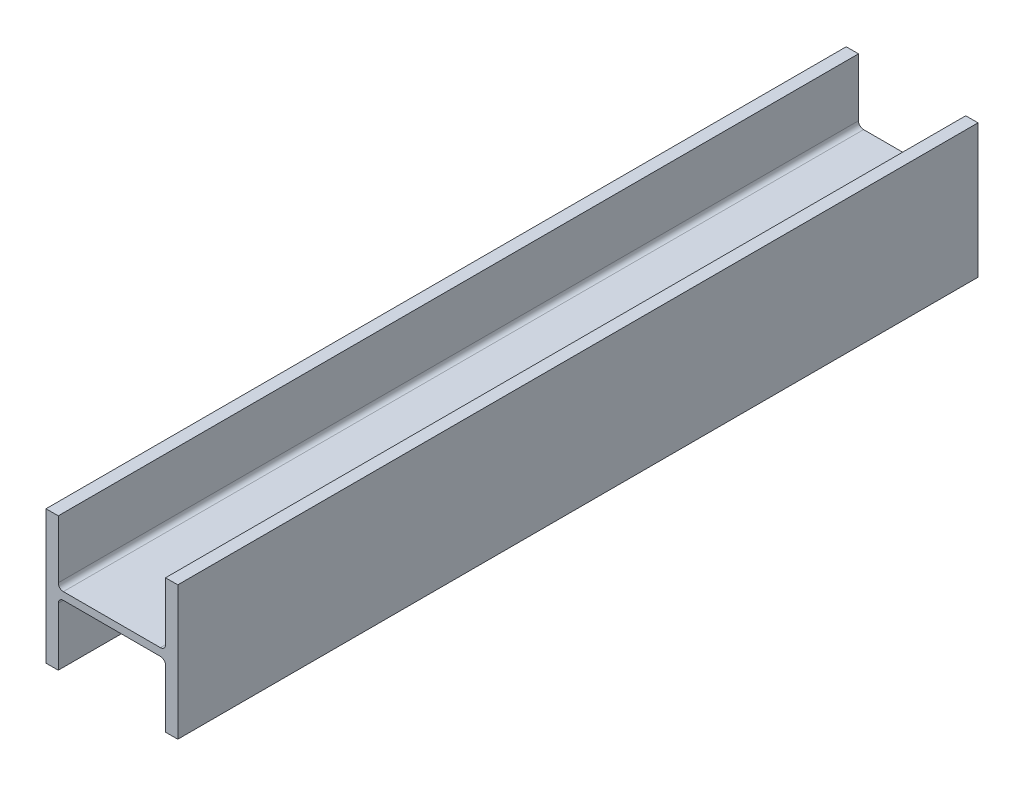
ISO-10303-21;
HEADER;
FILE_DESCRIPTION(('STEP AP214'),'2;1');
FILE_NAME('part.step','',(''),(''),'','','');
FILE_SCHEMA(('AUTOMOTIVE_DESIGN { 1 0 10303 214 1 1 1 1 }'));
ENDSEC;
DATA;
#1=APPLICATION_CONTEXT('core data for automotive mechanical design processes');
#2=APPLICATION_PROTOCOL_DEFINITION('international standard','automotive_design',2000,#1);
#3=PRODUCT_CONTEXT('',#1,'mechanical');
#4=PRODUCT('Part','Part','',(#3));
#5=PRODUCT_RELATED_PRODUCT_CATEGORY('part','',(#4));
#6=PRODUCT_DEFINITION_FORMATION('','',#4);
#7=PRODUCT_DEFINITION_CONTEXT('part definition',#1,'design');
#8=PRODUCT_DEFINITION('design','',#6,#7);
#9=PRODUCT_DEFINITION_SHAPE('','',#8);
#10=(LENGTH_UNIT() NAMED_UNIT(*) SI_UNIT(.MILLI.,.METRE.));
#11=(NAMED_UNIT(*) PLANE_ANGLE_UNIT() SI_UNIT($,.RADIAN.));
#12=(NAMED_UNIT(*) SI_UNIT($,.STERADIAN.) SOLID_ANGLE_UNIT());
#13=UNCERTAINTY_MEASURE_WITH_UNIT(LENGTH_MEASURE(1.E-05),#10,'distance_accuracy_value','');
#14=(GEOMETRIC_REPRESENTATION_CONTEXT(3) GLOBAL_UNCERTAINTY_ASSIGNED_CONTEXT((#13)) GLOBAL_UNIT_ASSIGNED_CONTEXT((#10,
#11,#12)) REPRESENTATION_CONTEXT('',''));
#15=CARTESIAN_POINT('',(0.,0.,0.));
#16=DIRECTION('',(0.,0.,1.));
#17=DIRECTION('',(1.,0.,0.));
#18=AXIS2_PLACEMENT_3D('',#15,#16,#17);
#19=CARTESIAN_POINT('',(196.596,199.517,1193.8));
#20=DIRECTION('',(-1.,0.,0.));
#21=DIRECTION('',(0.,0.,1.));
#22=AXIS2_PLACEMENT_3D('',#19,#20,#21);
#23=PLANE('',#22);
#24=DIRECTION('',(0.,1.,0.));
#25=VECTOR('',#24,1.);
#26=CARTESIAN_POINT('',(196.596,199.517,-1193.8));
#27=LINE('',#26,#25);
#28=CARTESIAN_POINT('',(196.596,-199.517,-1193.8));
#29=VERTEX_POINT('',#28);
#30=CARTESIAN_POINT('',(196.596,199.517,-1193.8));
#31=VERTEX_POINT('',#30);
#32=EDGE_CURVE('E195',#29,#31,#27,.T.);
#33=ORIENTED_EDGE('',*,*,#32,.T.);
#34=DIRECTION('',(0.,0.,-1.));
#35=VECTOR('',#34,1.);
#36=CARTESIAN_POINT('',(196.596,199.517,1193.8));
#37=LINE('',#36,#35);
#38=CARTESIAN_POINT('',(196.596,199.517,1193.8));
#39=VERTEX_POINT('',#38);
#40=EDGE_CURVE('E11',#39,#31,#37,.T.);
#41=ORIENTED_EDGE('',*,*,#40,.F.);
#42=DIRECTION('',(0.,1.,0.));
#43=VECTOR('',#42,1.);
#44=CARTESIAN_POINT('',(196.596,199.517,1193.8));
#45=LINE('',#44,#43);
#46=CARTESIAN_POINT('',(196.596,-199.517,1193.8));
#47=VERTEX_POINT('',#46);
#48=EDGE_CURVE('E238',#47,#39,#45,.T.);
#49=ORIENTED_EDGE('',*,*,#48,.F.);
#50=DIRECTION('',(0.,0.,-1.));
#51=VECTOR('',#50,1.);
#52=CARTESIAN_POINT('',(196.596,-199.517,1193.8));
#53=LINE('',#52,#51);
#54=EDGE_CURVE('E188',#47,#29,#53,.T.);
#55=ORIENTED_EDGE('',*,*,#54,.T.);
#56=EDGE_LOOP('',(#33,#41,#49,#55));
#57=FACE_BOUND('',#56,.T.);
#58=ADVANCED_FACE('F44',(#57),#23,.F.);
#59=CARTESIAN_POINT('',(160.02,199.517,1193.8));
#60=DIRECTION('',(0.,-1.,0.));
#61=DIRECTION('',(0.,0.,-1.));
#62=AXIS2_PLACEMENT_3D('',#59,#60,#61);
#63=PLANE('',#62);
#64=DIRECTION('',(-1.,0.,0.));
#65=VECTOR('',#64,1.);
#66=CARTESIAN_POINT('',(160.02,199.517,-1193.8));
#67=LINE('',#66,#65);
#68=CARTESIAN_POINT('',(160.02,199.517,-1193.8));
#69=VERTEX_POINT('',#68);
#70=EDGE_CURVE('E196',#31,#69,#67,.T.);
#71=ORIENTED_EDGE('',*,*,#70,.T.);
#72=DIRECTION('',(0.,0.,-1.));
#73=VECTOR('',#72,1.);
#74=CARTESIAN_POINT('',(160.02,199.517,1193.8));
#75=LINE('',#74,#73);
#76=CARTESIAN_POINT('',(160.02,199.517,1193.8));
#77=VERTEX_POINT('',#76);
#78=EDGE_CURVE('E53',#77,#69,#75,.T.);
#79=ORIENTED_EDGE('',*,*,#78,.F.);
#80=DIRECTION('',(-1.,0.,0.));
#81=VECTOR('',#80,1.);
#82=CARTESIAN_POINT('',(160.02,199.517,1193.8));
#83=LINE('',#82,#81);
#84=EDGE_CURVE('E129',#39,#77,#83,.T.);
#85=ORIENTED_EDGE('',*,*,#84,.F.);
#86=ORIENTED_EDGE('',*,*,#40,.T.);
#87=EDGE_LOOP('',(#71,#79,#85,#86));
#88=FACE_BOUND('',#87,.T.);
#89=ADVANCED_FACE('F362',(#88),#63,.F.);
#90=CARTESIAN_POINT('',(160.02,26.5430000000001,1193.8));
#91=DIRECTION('',(1.,0.,0.));
#92=DIRECTION('',(0.,0.,-1.));
#93=AXIS2_PLACEMENT_3D('',#90,#91,#92);
#94=PLANE('',#93);
#95=DIRECTION('',(0.,-1.,0.));
#96=VECTOR('',#95,1.);
#97=CARTESIAN_POINT('',(160.02,26.5430000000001,-1193.8));
#98=LINE('',#97,#96);
#99=CARTESIAN_POINT('',(160.02,26.5430000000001,-1193.8));
#100=VERTEX_POINT('',#99);
#101=EDGE_CURVE('E203',#69,#100,#98,.T.);
#102=ORIENTED_EDGE('',*,*,#101,.T.);
#103=DIRECTION('',(0.,0.,-1.));
#104=VECTOR('',#103,1.);
#105=CARTESIAN_POINT('',(160.02,26.5430000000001,1193.8));
#106=LINE('',#105,#104);
#107=CARTESIAN_POINT('',(160.02,26.5430000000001,1193.8));
#108=VERTEX_POINT('',#107);
#109=EDGE_CURVE('E285',#108,#100,#106,.T.);
#110=ORIENTED_EDGE('',*,*,#109,.F.);
#111=DIRECTION('',(0.,-1.,0.));
#112=VECTOR('',#111,1.);
#113=CARTESIAN_POINT('',(160.02,26.5430000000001,1193.8));
#114=LINE('',#113,#112);
#115=EDGE_CURVE('E291',#77,#108,#114,.T.);
#116=ORIENTED_EDGE('',*,*,#115,.F.);
#117=ORIENTED_EDGE('',*,*,#78,.T.);
#118=EDGE_LOOP('',(#102,#110,#116,#117));
#119=FACE_BOUND('',#118,.T.);
#120=ADVANCED_FACE('F292',(#119),#94,.F.);
#121=CARTESIAN_POINT('',(144.78,26.5430000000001,1193.8));
#122=DIRECTION('',(0.,0.,-1.));
#123=DIRECTION('',(-1.,0.,0.));
#124=AXIS2_PLACEMENT_3D('',#121,#122,#123);
#125=CYLINDRICAL_SURFACE('',#124,15.24);
#126=CARTESIAN_POINT('',(144.78,26.5430000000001,-1193.8));
#127=DIRECTION('',(0.,0.,-1.));
#128=DIRECTION('',(1.,0.,0.));
#129=AXIS2_PLACEMENT_3D('',#126,#127,#128);
#130=CIRCLE('',#129,15.24);
#131=CARTESIAN_POINT('',(144.78,11.3030000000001,-1193.8));
#132=VERTEX_POINT('',#131);
#133=EDGE_CURVE('E204',#100,#132,#130,.T.);
#134=ORIENTED_EDGE('',*,*,#133,.T.);
#135=DIRECTION('',(0.,0.,-1.));
#136=VECTOR('',#135,1.);
#137=CARTESIAN_POINT('',(144.78,11.3030000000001,1193.8));
#138=LINE('',#137,#136);
#139=CARTESIAN_POINT('',(144.78,11.3030000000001,1193.8));
#140=VERTEX_POINT('',#139);
#141=EDGE_CURVE('E276',#140,#132,#138,.T.);
#142=ORIENTED_EDGE('',*,*,#141,.F.);
#143=CARTESIAN_POINT('',(144.78,26.5430000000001,1193.8));
#144=DIRECTION('',(0.,0.,-1.));
#145=DIRECTION('',(1.,0.,0.));
#146=AXIS2_PLACEMENT_3D('',#143,#144,#145);
#147=CIRCLE('',#146,15.24);
#148=EDGE_CURVE('E315',#108,#140,#147,.T.);
#149=ORIENTED_EDGE('',*,*,#148,.F.);
#150=ORIENTED_EDGE('',*,*,#109,.T.);
#151=EDGE_LOOP('',(#134,#142,#149,#150));
#152=FACE_BOUND('',#151,.T.);
#153=ADVANCED_FACE('F304',(#152),#125,.F.);
#154=CARTESIAN_POINT('',(-144.78,11.3030000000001,1193.8));
#155=DIRECTION('',(0.,-1.,0.));
#156=DIRECTION('',(1.,0.,0.));
#157=AXIS2_PLACEMENT_3D('',#154,#155,#156);
#158=PLANE('',#157);
#159=DIRECTION('',(-1.,0.,0.));
#160=VECTOR('',#159,1.);
#161=CARTESIAN_POINT('',(-144.78,11.3030000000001,-1193.8));
#162=LINE('',#161,#160);
#163=CARTESIAN_POINT('',(-144.78,11.3030000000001,-1193.8));
#164=VERTEX_POINT('',#163);
#165=EDGE_CURVE('E210',#132,#164,#162,.T.);
#166=ORIENTED_EDGE('',*,*,#165,.T.);
#167=DIRECTION('',(0.,0.,-1.));
#168=VECTOR('',#167,1.);
#169=CARTESIAN_POINT('',(-144.78,11.3030000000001,1193.8));
#170=LINE('',#169,#168);
#171=CARTESIAN_POINT('',(-144.78,11.3030000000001,1193.8));
#172=VERTEX_POINT('',#171);
#173=EDGE_CURVE('E274',#172,#164,#170,.T.);
#174=ORIENTED_EDGE('',*,*,#173,.F.);
#175=DIRECTION('',(-1.,0.,0.));
#176=VECTOR('',#175,1.);
#177=CARTESIAN_POINT('',(-144.78,11.3030000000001,1193.8));
#178=LINE('',#177,#176);
#179=EDGE_CURVE('E306',#140,#172,#178,.T.);
#180=ORIENTED_EDGE('',*,*,#179,.F.);
#181=ORIENTED_EDGE('',*,*,#141,.T.);
#182=EDGE_LOOP('',(#166,#174,#180,#181));
#183=FACE_BOUND('',#182,.T.);
#184=ADVANCED_FACE('F308',(#183),#158,.F.);
#185=CARTESIAN_POINT('',(-144.78,26.5430000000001,1193.8));
#186=DIRECTION('',(0.,0.,-1.));
#187=DIRECTION('',(-1.,0.,0.));
#188=AXIS2_PLACEMENT_3D('',#185,#186,#187);
#189=CYLINDRICAL_SURFACE('',#188,15.24);
#190=CARTESIAN_POINT('',(-144.78,26.5430000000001,-1193.8));
#191=DIRECTION('',(0.,0.,-1.));
#192=DIRECTION('',(1.,0.,0.));
#193=AXIS2_PLACEMENT_3D('',#190,#191,#192);
#194=CIRCLE('',#193,15.24);
#195=CARTESIAN_POINT('',(-160.02,26.5430000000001,-1193.8));
#196=VERTEX_POINT('',#195);
#197=EDGE_CURVE('E209',#164,#196,#194,.T.);
#198=ORIENTED_EDGE('',*,*,#197,.T.);
#199=DIRECTION('',(0.,0.,-1.));
#200=VECTOR('',#199,1.);
#201=CARTESIAN_POINT('',(-160.02,26.5430000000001,1193.8));
#202=LINE('',#201,#200);
#203=CARTESIAN_POINT('',(-160.02,26.5430000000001,1193.8));
#204=VERTEX_POINT('',#203);
#205=EDGE_CURVE('E271',#204,#196,#202,.T.);
#206=ORIENTED_EDGE('',*,*,#205,.F.);
#207=CARTESIAN_POINT('',(-144.78,26.5430000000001,1193.8));
#208=DIRECTION('',(0.,0.,-1.));
#209=DIRECTION('',(1.,0.,0.));
#210=AXIS2_PLACEMENT_3D('',#207,#208,#209);
#211=CIRCLE('',#210,15.24);
#212=EDGE_CURVE('E313',#172,#204,#211,.T.);
#213=ORIENTED_EDGE('',*,*,#212,.F.);
#214=ORIENTED_EDGE('',*,*,#173,.T.);
#215=EDGE_LOOP('',(#198,#206,#213,#214));
#216=FACE_BOUND('',#215,.T.);
#217=ADVANCED_FACE('F374',(#216),#189,.F.);
#218=CARTESIAN_POINT('',(-160.02,199.517,1193.8));
#219=DIRECTION('',(-1.,0.,0.));
#220=DIRECTION('',(0.,0.,1.));
#221=AXIS2_PLACEMENT_3D('',#218,#219,#220);
#222=PLANE('',#221);
#223=DIRECTION('',(0.,1.,0.));
#224=VECTOR('',#223,1.);
#225=CARTESIAN_POINT('',(-160.02,199.517,-1193.8));
#226=LINE('',#225,#224);
#227=CARTESIAN_POINT('',(-160.02,199.517,-1193.8));
#228=VERTEX_POINT('',#227);
#229=EDGE_CURVE('E213',#196,#228,#226,.T.);
#230=ORIENTED_EDGE('',*,*,#229,.T.);
#231=DIRECTION('',(0.,0.,-1.));
#232=VECTOR('',#231,1.);
#233=CARTESIAN_POINT('',(-160.02,199.517,1193.8));
#234=LINE('',#233,#232);
#235=CARTESIAN_POINT('',(-160.02,199.517,1193.8));
#236=VERTEX_POINT('',#235);
#237=EDGE_CURVE('E270',#236,#228,#234,.T.);
#238=ORIENTED_EDGE('',*,*,#237,.F.);
#239=DIRECTION('',(0.,1.,0.));
#240=VECTOR('',#239,1.);
#241=CARTESIAN_POINT('',(-160.02,199.517,1193.8));
#242=LINE('',#241,#240);
#243=EDGE_CURVE('E316',#204,#236,#242,.T.);
#244=ORIENTED_EDGE('',*,*,#243,.F.);
#245=ORIENTED_EDGE('',*,*,#205,.T.);
#246=EDGE_LOOP('',(#230,#238,#244,#245));
#247=FACE_BOUND('',#246,.T.);
#248=ADVANCED_FACE('F378',(#247),#222,.F.);
#249=CARTESIAN_POINT('',(-196.596,199.517,1193.8));
#250=DIRECTION('',(0.,-1.,0.));
#251=DIRECTION('',(1.,0.,0.));
#252=AXIS2_PLACEMENT_3D('',#249,#250,#251);
#253=PLANE('',#252);
#254=DIRECTION('',(-1.,0.,0.));
#255=VECTOR('',#254,1.);
#256=CARTESIAN_POINT('',(-196.596,199.517,-1193.8));
#257=LINE('',#256,#255);
#258=CARTESIAN_POINT('',(-196.596,199.517,-1193.8));
#259=VERTEX_POINT('',#258);
#260=EDGE_CURVE('E216',#228,#259,#257,.T.);
#261=ORIENTED_EDGE('',*,*,#260,.T.);
#262=DIRECTION('',(0.,0.,-1.));
#263=VECTOR('',#262,1.);
#264=CARTESIAN_POINT('',(-196.596,199.517,1193.8));
#265=LINE('',#264,#263);
#266=CARTESIAN_POINT('',(-196.596,199.517,1193.8));
#267=VERTEX_POINT('',#266);
#268=EDGE_CURVE('E263',#267,#259,#265,.T.);
#269=ORIENTED_EDGE('',*,*,#268,.F.);
#270=DIRECTION('',(-1.,0.,0.));
#271=VECTOR('',#270,1.);
#272=CARTESIAN_POINT('',(-196.596,199.517,1193.8));
#273=LINE('',#272,#271);
#274=EDGE_CURVE('E323',#236,#267,#273,.T.);
#275=ORIENTED_EDGE('',*,*,#274,.F.);
#276=ORIENTED_EDGE('',*,*,#237,.T.);
#277=EDGE_LOOP('',(#261,#269,#275,#276));
#278=FACE_BOUND('',#277,.T.);
#279=ADVANCED_FACE('F385',(#278),#253,.F.);
#280=CARTESIAN_POINT('',(-196.596,-199.517,1193.8));
#281=DIRECTION('',(1.,0.,0.));
#282=DIRECTION('',(0.,0.,-1.));
#283=AXIS2_PLACEMENT_3D('',#280,#281,#282);
#284=PLANE('',#283);
#285=DIRECTION('',(0.,-1.,0.));
#286=VECTOR('',#285,1.);
#287=CARTESIAN_POINT('',(-196.596,-199.517,-1193.8));
#288=LINE('',#287,#286);
#289=CARTESIAN_POINT('',(-196.596,-199.517,-1193.8));
#290=VERTEX_POINT('',#289);
#291=EDGE_CURVE('E218',#259,#290,#288,.T.);
#292=ORIENTED_EDGE('',*,*,#291,.T.);
#293=DIRECTION('',(0.,0.,-1.));
#294=VECTOR('',#293,1.);
#295=CARTESIAN_POINT('',(-196.596,-199.517,1193.8));
#296=LINE('',#295,#294);
#297=CARTESIAN_POINT('',(-196.596,-199.517,1193.8));
#298=VERTEX_POINT('',#297);
#299=EDGE_CURVE('E259',#298,#290,#296,.T.);
#300=ORIENTED_EDGE('',*,*,#299,.F.);
#301=DIRECTION('',(0.,-1.,0.));
#302=VECTOR('',#301,1.);
#303=CARTESIAN_POINT('',(-196.596,-199.517,1193.8));
#304=LINE('',#303,#302);
#305=EDGE_CURVE('E326',#267,#298,#304,.T.);
#306=ORIENTED_EDGE('',*,*,#305,.F.);
#307=ORIENTED_EDGE('',*,*,#268,.T.);
#308=EDGE_LOOP('',(#292,#300,#306,#307));
#309=FACE_BOUND('',#308,.T.);
#310=ADVANCED_FACE('F387',(#309),#284,.F.);
#311=CARTESIAN_POINT('',(-160.02,-199.517,1193.8));
#312=DIRECTION('',(0.,1.,0.));
#313=DIRECTION('',(0.,0.,1.));
#314=AXIS2_PLACEMENT_3D('',#311,#312,#313);
#315=PLANE('',#314);
#316=DIRECTION('',(1.,0.,0.));
#317=VECTOR('',#316,1.);
#318=CARTESIAN_POINT('',(-160.02,-199.517,-1193.8));
#319=LINE('',#318,#317);
#320=CARTESIAN_POINT('',(-160.02,-199.517,-1193.8));
#321=VERTEX_POINT('',#320);
#322=EDGE_CURVE('E225',#290,#321,#319,.T.);
#323=ORIENTED_EDGE('',*,*,#322,.T.);
#324=DIRECTION('',(0.,0.,-1.));
#325=VECTOR('',#324,1.);
#326=CARTESIAN_POINT('',(-160.02,-199.517,1193.8));
#327=LINE('',#326,#325);
#328=CARTESIAN_POINT('',(-160.02,-199.517,1193.8));
#329=VERTEX_POINT('',#328);
#330=EDGE_CURVE('E254',#329,#321,#327,.T.);
#331=ORIENTED_EDGE('',*,*,#330,.F.);
#332=DIRECTION('',(1.,0.,0.));
#333=VECTOR('',#332,1.);
#334=CARTESIAN_POINT('',(-160.02,-199.517,1193.8));
#335=LINE('',#334,#333);
#336=EDGE_CURVE('E328',#298,#329,#335,.T.);
#337=ORIENTED_EDGE('',*,*,#336,.F.);
#338=ORIENTED_EDGE('',*,*,#299,.T.);
#339=EDGE_LOOP('',(#323,#331,#337,#338));
#340=FACE_BOUND('',#339,.T.);
#341=ADVANCED_FACE('F388',(#340),#315,.F.);
#342=CARTESIAN_POINT('',(-160.02,-26.5429999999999,1193.8));
#343=DIRECTION('',(-1.,0.,0.));
#344=DIRECTION('',(0.,0.,1.));
#345=AXIS2_PLACEMENT_3D('',#342,#343,#344);
#346=PLANE('',#345);
#347=DIRECTION('',(0.,1.,0.));
#348=VECTOR('',#347,1.);
#349=CARTESIAN_POINT('',(-160.02,-26.5429999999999,-1193.8));
#350=LINE('',#349,#348);
#351=CARTESIAN_POINT('',(-160.02,-26.5429999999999,-1193.8));
#352=VERTEX_POINT('',#351);
#353=EDGE_CURVE('E223',#321,#352,#350,.T.);
#354=ORIENTED_EDGE('',*,*,#353,.T.);
#355=DIRECTION('',(0.,0.,-1.));
#356=VECTOR('',#355,1.);
#357=CARTESIAN_POINT('',(-160.02,-26.5429999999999,1193.8));
#358=LINE('',#357,#356);
#359=CARTESIAN_POINT('',(-160.02,-26.5429999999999,1193.8));
#360=VERTEX_POINT('',#359);
#361=EDGE_CURVE('E253',#360,#352,#358,.T.);
#362=ORIENTED_EDGE('',*,*,#361,.F.);
#363=DIRECTION('',(0.,1.,0.));
#364=VECTOR('',#363,1.);
#365=CARTESIAN_POINT('',(-160.02,-26.5429999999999,1193.8));
#366=LINE('',#365,#364);
#367=EDGE_CURVE('E335',#329,#360,#366,.T.);
#368=ORIENTED_EDGE('',*,*,#367,.F.);
#369=ORIENTED_EDGE('',*,*,#330,.T.);
#370=EDGE_LOOP('',(#354,#362,#368,#369));
#371=FACE_BOUND('',#370,.T.);
#372=ADVANCED_FACE('F391',(#371),#346,.F.);
#373=CARTESIAN_POINT('',(-144.78,-26.5429999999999,1193.8));
#374=DIRECTION('',(0.,0.,-1.));
#375=DIRECTION('',(-1.,0.,0.));
#376=AXIS2_PLACEMENT_3D('',#373,#374,#375);
#377=CYLINDRICAL_SURFACE('',#376,15.24);
#378=CARTESIAN_POINT('',(-144.78,-26.5429999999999,-1193.8));
#379=DIRECTION('',(0.,0.,-1.));
#380=DIRECTION('',(1.,0.,0.));
#381=AXIS2_PLACEMENT_3D('',#378,#379,#380);
#382=CIRCLE('',#381,15.24);
#383=CARTESIAN_POINT('',(-144.78,-11.3029999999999,-1193.8));
#384=VERTEX_POINT('',#383);
#385=EDGE_CURVE('E230',#352,#384,#382,.T.);
#386=ORIENTED_EDGE('',*,*,#385,.T.);
#387=DIRECTION('',(0.,0.,-1.));
#388=VECTOR('',#387,1.);
#389=CARTESIAN_POINT('',(-144.78,-11.3029999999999,1193.8));
#390=LINE('',#389,#388);
#391=CARTESIAN_POINT('',(-144.78,-11.3029999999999,1193.8));
#392=VERTEX_POINT('',#391);
#393=EDGE_CURVE('E249',#392,#384,#390,.T.);
#394=ORIENTED_EDGE('',*,*,#393,.F.);
#395=CARTESIAN_POINT('',(-144.78,-26.5429999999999,1193.8));
#396=DIRECTION('',(0.,0.,-1.));
#397=DIRECTION('',(1.,0.,0.));
#398=AXIS2_PLACEMENT_3D('',#395,#396,#397);
#399=CIRCLE('',#398,15.24);
#400=EDGE_CURVE('E333',#360,#392,#399,.T.);
#401=ORIENTED_EDGE('',*,*,#400,.F.);
#402=ORIENTED_EDGE('',*,*,#361,.T.);
#403=EDGE_LOOP('',(#386,#394,#401,#402));
#404=FACE_BOUND('',#403,.T.);
#405=ADVANCED_FACE('F342',(#404),#377,.F.);
#406=CARTESIAN_POINT('',(144.78,-11.3029999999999,1193.8));
#407=DIRECTION('',(0.,1.,0.));
#408=DIRECTION('',(0.,0.,1.));
#409=AXIS2_PLACEMENT_3D('',#406,#407,#408);
#410=PLANE('',#409);
#411=DIRECTION('',(1.,0.,0.));
#412=VECTOR('',#411,1.);
#413=CARTESIAN_POINT('',(144.78,-11.3029999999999,-1193.8));
#414=LINE('',#413,#412);
#415=CARTESIAN_POINT('',(144.78,-11.3029999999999,-1193.8));
#416=VERTEX_POINT('',#415);
#417=EDGE_CURVE('E233',#384,#416,#414,.T.);
#418=ORIENTED_EDGE('',*,*,#417,.T.);
#419=DIRECTION('',(0.,0.,-1.));
#420=VECTOR('',#419,1.);
#421=CARTESIAN_POINT('',(144.78,-11.3029999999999,1193.8));
#422=LINE('',#421,#420);
#423=CARTESIAN_POINT('',(144.78,-11.3029999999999,1193.8));
#424=VERTEX_POINT('',#423);
#425=EDGE_CURVE('E181',#424,#416,#422,.T.);
#426=ORIENTED_EDGE('',*,*,#425,.F.);
#427=DIRECTION('',(1.,0.,0.));
#428=VECTOR('',#427,1.);
#429=CARTESIAN_POINT('',(144.78,-11.3029999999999,1193.8));
#430=LINE('',#429,#428);
#431=EDGE_CURVE('E174',#392,#424,#430,.T.);
#432=ORIENTED_EDGE('',*,*,#431,.F.);
#433=ORIENTED_EDGE('',*,*,#393,.T.);
#434=EDGE_LOOP('',(#418,#426,#432,#433));
#435=FACE_BOUND('',#434,.T.);
#436=ADVANCED_FACE('F350',(#435),#410,.F.);
#437=CARTESIAN_POINT('',(144.78,-26.5429999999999,1193.8));
#438=DIRECTION('',(0.,0.,-1.));
#439=DIRECTION('',(-1.,0.,0.));
#440=AXIS2_PLACEMENT_3D('',#437,#438,#439);
#441=CYLINDRICAL_SURFACE('',#440,15.24);
#442=CARTESIAN_POINT('',(144.78,-26.5429999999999,-1193.8));
#443=DIRECTION('',(0.,0.,-1.));
#444=DIRECTION('',(1.,0.,0.));
#445=AXIS2_PLACEMENT_3D('',#442,#443,#444);
#446=CIRCLE('',#445,15.24);
#447=CARTESIAN_POINT('',(160.02,-26.5429999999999,-1193.8));
#448=VERTEX_POINT('',#447);
#449=EDGE_CURVE('E182',#416,#448,#446,.T.);
#450=ORIENTED_EDGE('',*,*,#449,.T.);
#451=DIRECTION('',(0.,0.,-1.));
#452=VECTOR('',#451,1.);
#453=CARTESIAN_POINT('',(160.02,-26.5429999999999,1193.8));
#454=LINE('',#453,#452);
#455=CARTESIAN_POINT('',(160.02,-26.5429999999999,1193.8));
#456=VERTEX_POINT('',#455);
#457=EDGE_CURVE('E177',#456,#448,#454,.T.);
#458=ORIENTED_EDGE('',*,*,#457,.F.);
#459=CARTESIAN_POINT('',(144.78,-26.5429999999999,1193.8));
#460=DIRECTION('',(0.,0.,-1.));
#461=DIRECTION('',(1.,0.,0.));
#462=AXIS2_PLACEMENT_3D('',#459,#460,#461);
#463=CIRCLE('',#462,15.24);
#464=EDGE_CURVE('E167',#424,#456,#463,.T.);
#465=ORIENTED_EDGE('',*,*,#464,.F.);
#466=ORIENTED_EDGE('',*,*,#425,.T.);
#467=EDGE_LOOP('',(#450,#458,#465,#466));
#468=FACE_BOUND('',#467,.T.);
#469=ADVANCED_FACE('F180',(#468),#441,.F.);
#470=CARTESIAN_POINT('',(160.02,-199.517,1193.8));
#471=DIRECTION('',(1.,0.,0.));
#472=DIRECTION('',(0.,0.,-1.));
#473=AXIS2_PLACEMENT_3D('',#470,#471,#472);
#474=PLANE('',#473);
#475=DIRECTION('',(0.,-1.,0.));
#476=VECTOR('',#475,1.);
#477=CARTESIAN_POINT('',(160.02,-199.517,-1193.8));
#478=LINE('',#477,#476);
#479=CARTESIAN_POINT('',(160.02,-199.517,-1193.8));
#480=VERTEX_POINT('',#479);
#481=EDGE_CURVE('E113',#448,#480,#478,.T.);
#482=ORIENTED_EDGE('',*,*,#481,.T.);
#483=DIRECTION('',(0.,0.,-1.));
#484=VECTOR('',#483,1.);
#485=CARTESIAN_POINT('',(160.02,-199.517,1193.8));
#486=LINE('',#485,#484);
#487=CARTESIAN_POINT('',(160.02,-199.517,1193.8));
#488=VERTEX_POINT('',#487);
#489=EDGE_CURVE('E184',#488,#480,#486,.T.);
#490=ORIENTED_EDGE('',*,*,#489,.F.);
#491=DIRECTION('',(0.,-1.,0.));
#492=VECTOR('',#491,1.);
#493=CARTESIAN_POINT('',(160.02,-199.517,1193.8));
#494=LINE('',#493,#492);
#495=EDGE_CURVE('E168',#456,#488,#494,.T.);
#496=ORIENTED_EDGE('',*,*,#495,.F.);
#497=ORIENTED_EDGE('',*,*,#457,.T.);
#498=EDGE_LOOP('',(#482,#490,#496,#497));
#499=FACE_BOUND('',#498,.T.);
#500=ADVANCED_FACE('F187',(#499),#474,.F.);
#501=CARTESIAN_POINT('',(196.596,-199.517,1193.8));
#502=DIRECTION('',(0.,1.,0.));
#503=DIRECTION('',(0.,0.,1.));
#504=AXIS2_PLACEMENT_3D('',#501,#502,#503);
#505=PLANE('',#504);
#506=DIRECTION('',(1.,0.,0.));
#507=VECTOR('',#506,1.);
#508=CARTESIAN_POINT('',(196.596,-199.517,-1193.8));
#509=LINE('',#508,#507);
#510=EDGE_CURVE('E123',#480,#29,#509,.T.);
#511=ORIENTED_EDGE('',*,*,#510,.T.);
#512=ORIENTED_EDGE('',*,*,#54,.F.);
#513=DIRECTION('',(1.,0.,0.));
#514=VECTOR('',#513,1.);
#515=CARTESIAN_POINT('',(196.596,-199.517,1193.8));
#516=LINE('',#515,#514);
#517=EDGE_CURVE('E64',#488,#47,#516,.T.);
#518=ORIENTED_EDGE('',*,*,#517,.F.);
#519=ORIENTED_EDGE('',*,*,#489,.T.);
#520=EDGE_LOOP('',(#511,#512,#518,#519));
#521=FACE_BOUND('',#520,.T.);
#522=ADVANCED_FACE('F352',(#521),#505,.F.);
#523=CARTESIAN_POINT('',(144.78,-26.5429999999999,1193.8));
#524=DIRECTION('',(0.,0.,1.));
#525=DIRECTION('',(1.,0.,0.));
#526=AXIS2_PLACEMENT_3D('',#523,#524,#525);
#527=PLANE('',#526);
#528=ORIENTED_EDGE('',*,*,#48,.T.);
#529=ORIENTED_EDGE('',*,*,#84,.T.);
#530=ORIENTED_EDGE('',*,*,#115,.T.);
#531=ORIENTED_EDGE('',*,*,#148,.T.);
#532=ORIENTED_EDGE('',*,*,#179,.T.);
#533=ORIENTED_EDGE('',*,*,#212,.T.);
#534=ORIENTED_EDGE('',*,*,#243,.T.);
#535=ORIENTED_EDGE('',*,*,#274,.T.);
#536=ORIENTED_EDGE('',*,*,#305,.T.);
#537=ORIENTED_EDGE('',*,*,#336,.T.);
#538=ORIENTED_EDGE('',*,*,#367,.T.);
#539=ORIENTED_EDGE('',*,*,#400,.T.);
#540=ORIENTED_EDGE('',*,*,#431,.T.);
#541=ORIENTED_EDGE('',*,*,#464,.T.);
#542=ORIENTED_EDGE('',*,*,#495,.T.);
#543=ORIENTED_EDGE('',*,*,#517,.T.);
#544=EDGE_LOOP('',(#528,#529,#530,#531,#532,#533,#534,#535,#536,#537,#538,#539,#540,#541,#542,#543));
#545=FACE_BOUND('',#544,.T.);
#546=ADVANCED_FACE('F169',(#545),#527,.T.);
#547=CARTESIAN_POINT('',(144.78,-26.5429999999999,-1193.8));
#548=DIRECTION('',(0.,0.,1.));
#549=DIRECTION('',(1.,0.,0.));
#550=AXIS2_PLACEMENT_3D('',#547,#548,#549);
#551=PLANE('',#550);
#552=ORIENTED_EDGE('',*,*,#32,.F.);
#553=ORIENTED_EDGE('',*,*,#510,.F.);
#554=ORIENTED_EDGE('',*,*,#481,.F.);
#555=ORIENTED_EDGE('',*,*,#449,.F.);
#556=ORIENTED_EDGE('',*,*,#417,.F.);
#557=ORIENTED_EDGE('',*,*,#385,.F.);
#558=ORIENTED_EDGE('',*,*,#353,.F.);
#559=ORIENTED_EDGE('',*,*,#322,.F.);
#560=ORIENTED_EDGE('',*,*,#291,.F.);
#561=ORIENTED_EDGE('',*,*,#260,.F.);
#562=ORIENTED_EDGE('',*,*,#229,.F.);
#563=ORIENTED_EDGE('',*,*,#197,.F.);
#564=ORIENTED_EDGE('',*,*,#165,.F.);
#565=ORIENTED_EDGE('',*,*,#133,.F.);
#566=ORIENTED_EDGE('',*,*,#101,.F.);
#567=ORIENTED_EDGE('',*,*,#70,.F.);
#568=EDGE_LOOP('',(#552,#553,#554,#555,#556,#557,#558,#559,#560,#561,#562,#563,#564,#565,#566,#567));
#569=FACE_BOUND('',#568,.T.);
#570=ADVANCED_FACE('F299',(#569),#551,.F.);
#571=CLOSED_SHELL('',(#58,#89,#120,#153,#184,#217,#248,#279,#310,#341,#372,#405,#436,#469,#500,
#522,#546,#570));
#572=MANIFOLD_SOLID_BREP('B2',#571);
#573=ADVANCED_BREP_SHAPE_REPRESENTATION('',(#18,#572),#14);
#574=SHAPE_DEFINITION_REPRESENTATION(#9,#573);
ENDSEC;
END-ISO-10303-21;
